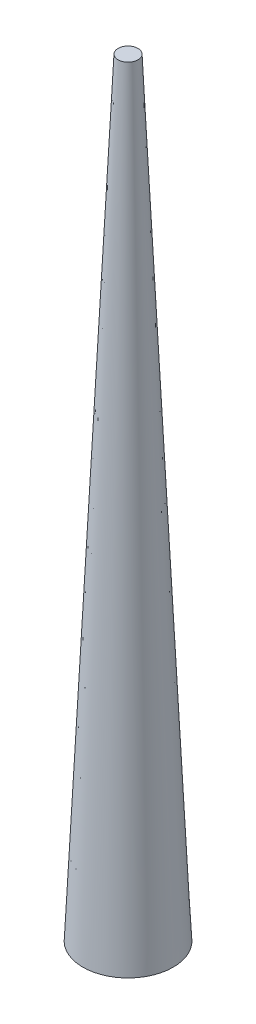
from build123d import *

# Parameters (mm, degrees)
REVOLVE1_ANGLE = 359.99999999


with BuildPart() as part:
    # Sketch1 → Revolve1 (revolve)
    with BuildSketch(Plane.XY):
        Polygon((0, 90000), (5000, 90000), (1100, 175000), (0, 175000), align=None)
    revolve(axis=Axis((0, 90000, 0), (0, 1, 0)), revolution_arc=REVOLVE1_ANGLE)


solid = part.part
